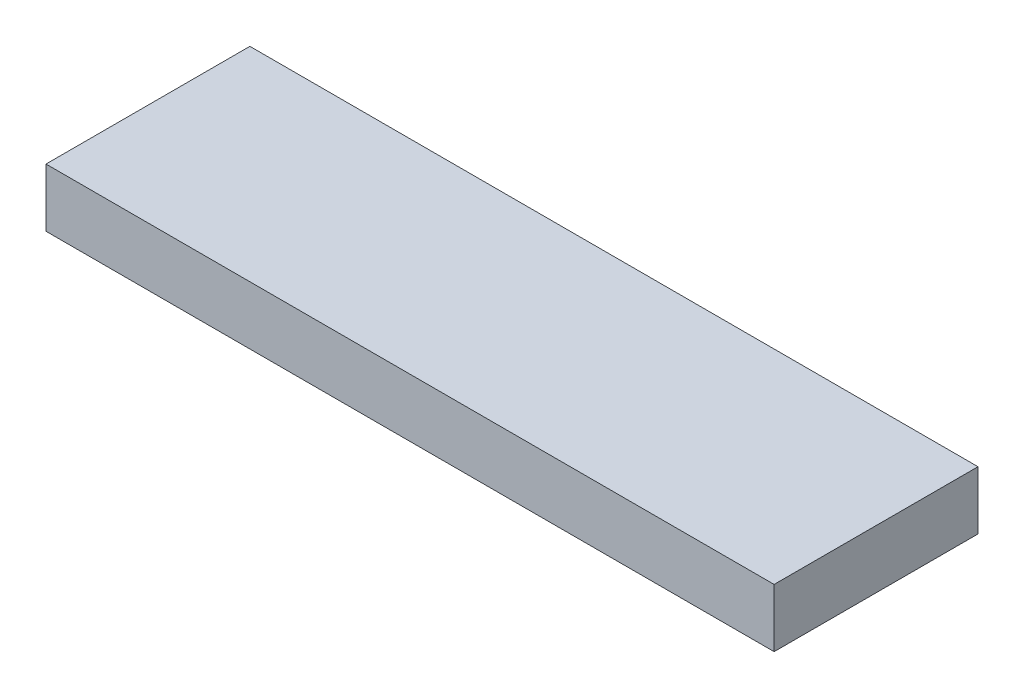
from build123d import *

# Parameters (mm, degrees)
ESQUISSE1_W      = 250
ESQUISSE1_H      = 20
EXTRUSION1_DEPTH = 35


with BuildPart() as part:
    # Esquisse1 → Extrusion1 (new, symmetric)
    with BuildSketch(Plane.XY):
        with Locations((125, -10)):
            Rectangle(ESQUISSE1_W, ESQUISSE1_H)
    extrude(amount=EXTRUSION1_DEPTH, both=True)


solid = part.part
